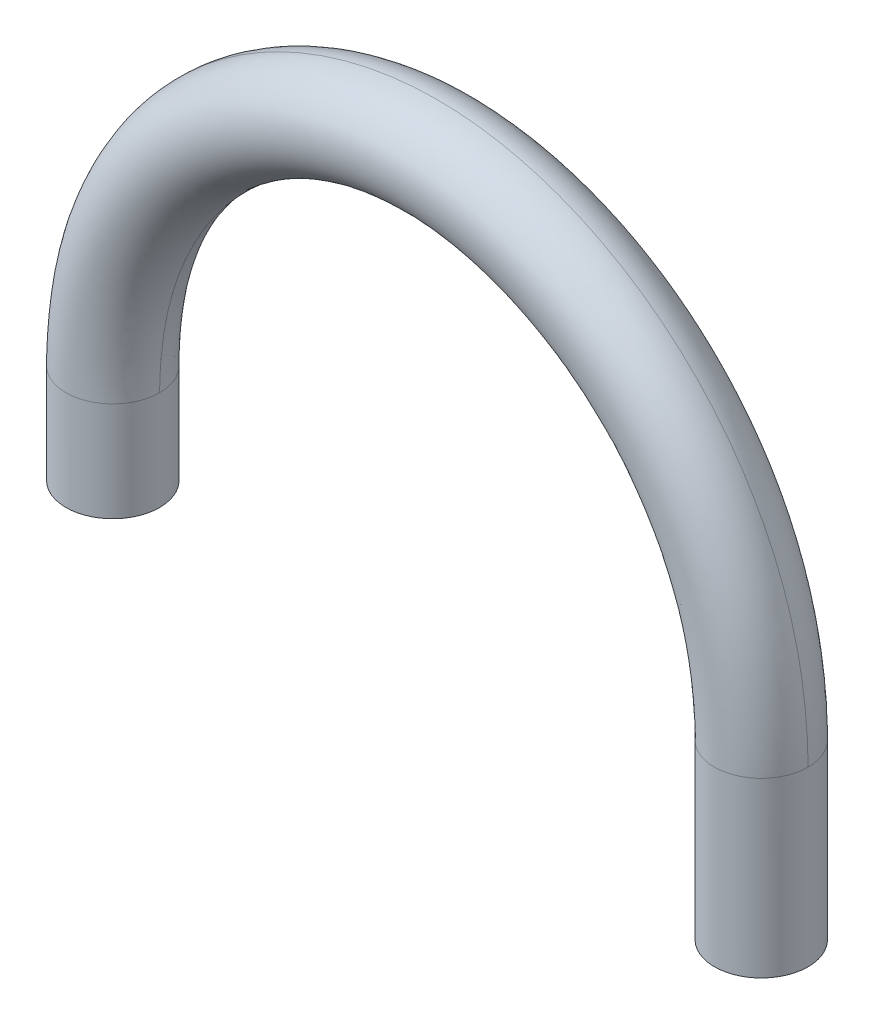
ISO-10303-21;
HEADER;
FILE_DESCRIPTION(('STEP AP214'),'2;1');
FILE_NAME('part.step','',(''),(''),'','','');
FILE_SCHEMA(('AUTOMOTIVE_DESIGN { 1 0 10303 214 1 1 1 1 }'));
ENDSEC;
DATA;
#1=APPLICATION_CONTEXT('core data for automotive mechanical design processes');
#2=APPLICATION_PROTOCOL_DEFINITION('international standard','automotive_design',2000,#1);
#3=PRODUCT_CONTEXT('',#1,'mechanical');
#4=PRODUCT('Part','Part','',(#3));
#5=PRODUCT_RELATED_PRODUCT_CATEGORY('part','',(#4));
#6=PRODUCT_DEFINITION_FORMATION('','',#4);
#7=PRODUCT_DEFINITION_CONTEXT('part definition',#1,'design');
#8=PRODUCT_DEFINITION('design','',#6,#7);
#9=PRODUCT_DEFINITION_SHAPE('','',#8);
#10=(LENGTH_UNIT() NAMED_UNIT(*) SI_UNIT(.MILLI.,.METRE.));
#11=(NAMED_UNIT(*) PLANE_ANGLE_UNIT() SI_UNIT($,.RADIAN.));
#12=(NAMED_UNIT(*) SI_UNIT($,.STERADIAN.) SOLID_ANGLE_UNIT());
#13=UNCERTAINTY_MEASURE_WITH_UNIT(LENGTH_MEASURE(1.E-05),#10,'distance_accuracy_value','');
#14=(GEOMETRIC_REPRESENTATION_CONTEXT(3) GLOBAL_UNCERTAINTY_ASSIGNED_CONTEXT((#13)) GLOBAL_UNIT_ASSIGNED_CONTEXT((#10,
#11,#12)) REPRESENTATION_CONTEXT('',''));
#15=CARTESIAN_POINT('',(0.,0.,0.));
#16=DIRECTION('',(0.,0.,1.));
#17=DIRECTION('',(1.,0.,0.));
#18=AXIS2_PLACEMENT_3D('',#15,#16,#17);
#19=CARTESIAN_POINT('',(-96.055,25.5,-16.445));
#20=DIRECTION('',(0.,1.,0.));
#21=DIRECTION('',(-1.,0.,0.));
#22=AXIS2_PLACEMENT_3D('',#19,#20,#21);
#23=PLANE('',#22);
#24=CARTESIAN_POINT('',(-112.5,25.5,0.));
#25=DIRECTION('',(0.,-1.,0.));
#26=DIRECTION('',(1.,0.,0.));
#27=AXIS2_PLACEMENT_3D('',#24,#25,#26);
#28=CIRCLE('',#27,16.25);
#29=CARTESIAN_POINT('',(-96.25,25.5,0.));
#30=VERTEX_POINT('',#29);
#31=EDGE_CURVE('E20',#30,#30,#28,.T.);
#32=ORIENTED_EDGE('',*,*,#31,.T.);
#33=EDGE_LOOP('',(#32));
#34=FACE_BOUND('',#33,.T.);
#35=ADVANCED_FACE('F16',(#34),#23,.F.);
#36=CARTESIAN_POINT('',(96.055,0.,-16.445));
#37=DIRECTION('',(0.,-1.,0.));
#38=DIRECTION('',(1.,0.,0.));
#39=AXIS2_PLACEMENT_3D('',#36,#37,#38);
#40=PLANE('',#39);
#41=CARTESIAN_POINT('',(112.5,0.,0.));
#42=DIRECTION('',(0.,-1.,0.));
#43=DIRECTION('',(1.,0.,0.));
#44=AXIS2_PLACEMENT_3D('',#41,#42,#43);
#45=CIRCLE('',#44,16.25);
#46=CARTESIAN_POINT('',(128.75,0.,0.));
#47=VERTEX_POINT('',#46);
#48=EDGE_CURVE('E52',#47,#47,#45,.T.);
#49=ORIENTED_EDGE('',*,*,#48,.T.);
#50=EDGE_LOOP('',(#49));
#51=FACE_BOUND('',#50,.T.);
#52=ADVANCED_FACE('F18',(#51),#40,.T.);
#53=CARTESIAN_POINT('',(-112.5,60.,0.));
#54=DIRECTION('',(0.,-1.,0.));
#55=DIRECTION('',(1.,0.,0.));
#56=AXIS2_PLACEMENT_3D('',#53,#54,#55);
#57=CYLINDRICAL_SURFACE('',#56,16.25);
#58=ORIENTED_EDGE('',*,*,#31,.F.);
#59=EDGE_LOOP('',(#58));
#60=FACE_BOUND('',#59,.T.);
#61=CARTESIAN_POINT('',(-112.5,60.,0.));
#62=DIRECTION('',(0.,-1.,0.));
#63=DIRECTION('',(0.,0.,-1.));
#64=AXIS2_PLACEMENT_3D('',#61,#62,#63);
#65=CIRCLE('',#64,16.25);
#66=CARTESIAN_POINT('',(-128.75,60.,1.56280283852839E-09));
#67=VERTEX_POINT('',#66);
#68=CARTESIAN_POINT('',(-96.25,60.,1.6664638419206E-09));
#69=VERTEX_POINT('',#68);
#70=EDGE_CURVE('E26',#67,#69,#65,.T.);
#71=ORIENTED_EDGE('',*,*,#70,.T.);
#72=CARTESIAN_POINT('',(-112.5,60.,0.));
#73=DIRECTION('',(0.,-1.,0.));
#74=DIRECTION('',(0.,0.,-1.));
#75=AXIS2_PLACEMENT_3D('',#72,#73,#74);
#76=CIRCLE('',#75,16.25);
#77=EDGE_CURVE('E43',#69,#67,#76,.T.);
#78=ORIENTED_EDGE('',*,*,#77,.T.);
#79=EDGE_LOOP('',(#71,#78));
#80=FACE_BOUND('',#79,.T.);
#81=ADVANCED_FACE('F76',(#60,#80),#57,.T.);
#82=CARTESIAN_POINT('',(128.75,60.,0.));
#83=CARTESIAN_POINT('',(128.75,69.119381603,0.));
#84=CARTESIAN_POINT('',(126.787885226,90.221251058,0.));
#85=CARTESIAN_POINT('',(118.575613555,116.218092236,0.));
#86=CARTESIAN_POINT('',(105.814695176,139.782338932,0.));
#87=CARTESIAN_POINT('',(89.27785199,159.546384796,0.));
#88=CARTESIAN_POINT('',(69.728355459,175.473072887,0.));
#89=CARTESIAN_POINT('',(47.880351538,187.225005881,0.));
#90=CARTESIAN_POINT('',(24.433883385,194.543640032,0.));
#91=CARTESIAN_POINT('',(0.,197.103179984,0.));
#92=CARTESIAN_POINT('',(-24.433883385,194.543640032,0.));
#93=CARTESIAN_POINT('',(-47.880351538,187.225005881,0.));
#94=CARTESIAN_POINT('',(-69.728355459,175.473072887,0.));
#95=CARTESIAN_POINT('',(-89.27785199,159.546384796,0.));
#96=CARTESIAN_POINT('',(-105.814695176,139.782338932,0.));
#97=CARTESIAN_POINT('',(-118.575613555,116.218092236,0.));
#98=CARTESIAN_POINT('',(-126.787885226,90.221251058,0.));
#99=CARTESIAN_POINT('',(-128.75,69.119381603,0.));
#100=CARTESIAN_POINT('',(-128.75,60.,0.));
#101=CARTESIAN_POINT('',(128.75,60.,32.5));
#102=CARTESIAN_POINT('',(128.75,65.927697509,32.5));
#103=CARTESIAN_POINT('',(126.787885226,91.702516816,32.5));
#104=CARTESIAN_POINT('',(118.575613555,115.821188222,32.5));
#105=CARTESIAN_POINT('',(105.814695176,139.888689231,32.5));
#106=CARTESIAN_POINT('',(89.27785199,159.517887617,32.5));
#107=CARTESIAN_POINT('',(69.728355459,175.480711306,32.5));
#108=CARTESIAN_POINT('',(47.880351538,187.222949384,32.5));
#109=CARTESIAN_POINT('',(24.433883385,194.544227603,32.5));
#110=CARTESIAN_POINT('',(0.,197.102886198,32.5));
#111=CARTESIAN_POINT('',(-24.433883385,194.544227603,32.5));
#112=CARTESIAN_POINT('',(-47.880351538,187.222949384,32.5));
#113=CARTESIAN_POINT('',(-69.728355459,175.480711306,32.5));
#114=CARTESIAN_POINT('',(-89.27785199,159.517887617,32.5));
#115=CARTESIAN_POINT('',(-105.814695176,139.888689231,32.5));
#116=CARTESIAN_POINT('',(-118.575613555,115.821188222,32.5));
#117=CARTESIAN_POINT('',(-126.787885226,91.702516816,32.5));
#118=CARTESIAN_POINT('',(-128.75,65.927697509,32.5));
#119=CARTESIAN_POINT('',(-128.75,60.,32.5));
#120=CARTESIAN_POINT('',(96.25,60.,32.5));
#121=CARTESIAN_POINT('',(96.25,65.927697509,32.5));
#122=CARTESIAN_POINT('',(94.696489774,84.356921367,32.5));
#123=CARTESIAN_POINT('',(88.40680832,103.415634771,32.5));
#124=CARTESIAN_POINT('',(78.755617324,121.439526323,32.5));
#125=CARTESIAN_POINT('',(66.28855426,136.281328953,32.5));
#126=CARTESIAN_POINT('',(51.560707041,148.291936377,32.5));
#127=CARTESIAN_POINT('',(35.176289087,157.096584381,32.5));
#128=CARTESIAN_POINT('',(17.753616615,162.516638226,32.5));
#129=CARTESIAN_POINT('',(0.,164.366680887,32.5));
#130=CARTESIAN_POINT('',(-17.753616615,162.516638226,32.5));
#131=CARTESIAN_POINT('',(-35.176289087,157.096584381,32.5));
#132=CARTESIAN_POINT('',(-51.560707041,148.291936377,32.5));
#133=CARTESIAN_POINT('',(-66.28855426,136.281328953,32.5));
#134=CARTESIAN_POINT('',(-78.755617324,121.439526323,32.5));
#135=CARTESIAN_POINT('',(-88.40680832,103.415634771,32.5));
#136=CARTESIAN_POINT('',(-94.696489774,84.356921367,32.5));
#137=CARTESIAN_POINT('',(-96.25,65.927697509,32.5));
#138=CARTESIAN_POINT('',(-96.25,60.,32.5));
#139=CARTESIAN_POINT('',(96.25,60.,0.));
#140=CARTESIAN_POINT('',(96.25,67.523539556,0.));
#141=CARTESIAN_POINT('',(94.696489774,83.616288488,0.));
#142=CARTESIAN_POINT('',(88.40680832,103.614086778,0.));
#143=CARTESIAN_POINT('',(78.755617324,121.386351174,0.));
#144=CARTESIAN_POINT('',(66.28855426,136.295577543,0.));
#145=CARTESIAN_POINT('',(51.560707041,148.288117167,0.));
#146=CARTESIAN_POINT('',(35.176289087,157.097612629,0.));
#147=CARTESIAN_POINT('',(17.753616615,162.516344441,0.));
#148=CARTESIAN_POINT('',(0.,164.36682778,0.));
#149=CARTESIAN_POINT('',(-17.753616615,162.516344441,0.));
#150=CARTESIAN_POINT('',(-35.176289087,157.097612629,0.));
#151=CARTESIAN_POINT('',(-51.560707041,148.288117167,0.));
#152=CARTESIAN_POINT('',(-66.28855426,136.295577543,0.));
#153=CARTESIAN_POINT('',(-78.755617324,121.386351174,0.));
#154=CARTESIAN_POINT('',(-88.40680832,103.614086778,0.));
#155=CARTESIAN_POINT('',(-94.696489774,83.616288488,0.));
#156=CARTESIAN_POINT('',(-96.25,67.523539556,0.));
#157=CARTESIAN_POINT('',(-96.25,60.,0.));
#158=(BOUNDED_SURFACE() B_SPLINE_SURFACE(3,3,((#82,#83,#84,#85,#86,#87,#88,#89,#90,#91,#92,#93,
#94,#95,#96,#97,#98,#99,#100),(#101,#102,#103,#104,#105,#106,#107,#108,#109,#110,#111,#112,#113,
#114,#115,#116,#117,#118,#119),(#120,#121,#122,#123,#124,#125,#126,#127,#128,#129,#130,#131,
#132,#133,#134,#135,#136,#137,#138),(#139,#140,#141,#142,#143,#144,#145,#146,#147,#148,#149,
#150,#151,#152,#153,#154,#155,#156,#157)),.UNSPECIFIED.,.F.,.F.,
.F.) B_SPLINE_SURFACE_WITH_KNOTS((4,4),(4,1,1,1,1,1,1,1,1,1,1,1,1,1,1,1,4),(0.,0.5),(0.,
0.0624999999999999,0.125,0.1875,0.25,0.3125,0.375,0.437499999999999,0.5,0.562500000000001,0.625,
0.6875,0.75,0.8125,0.875,0.9375,1.),
.UNSPECIFIED.) GEOMETRIC_REPRESENTATION_ITEM() RATIONAL_B_SPLINE_SURFACE(((1.,1.,1.,1.,1.,1.,1.,
1.,1.,1.,1.,1.,1.,1.,1.,1.,1.,1.,1.),(0.333333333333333,0.333333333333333,0.333333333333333,
0.333333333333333,0.333333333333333,0.333333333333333,0.333333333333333,0.333333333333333,
0.333333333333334,0.333333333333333,0.333333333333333,0.333333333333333,0.333333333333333,
0.333333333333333,0.333333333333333,0.333333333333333,0.333333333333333,0.333333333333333,
0.333333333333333),(0.333333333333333,0.333333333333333,0.333333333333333,0.333333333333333,
0.333333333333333,0.333333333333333,0.333333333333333,0.333333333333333,0.333333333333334,
0.333333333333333,0.333333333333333,0.333333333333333,0.333333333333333,0.333333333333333,
0.333333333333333,0.333333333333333,0.333333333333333,0.333333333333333,0.333333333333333),(1.,
1.,1.,1.,1.,1.,1.,1.,1.,1.,1.,1.,1.,1.,1.,1.,1.,1.,1.))) REPRESENTATION_ITEM('') SURFACE());
#159=CARTESIAN_POINT('',(112.5,60.,0.));
#160=DIRECTION('',(0.,-1.,0.));
#161=DIRECTION('',(0.,0.,-1.));
#162=AXIS2_PLACEMENT_3D('',#159,#160,#161);
#163=CIRCLE('',#162,16.25);
#164=CARTESIAN_POINT('',(96.25,60.,1.56280283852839E-09));
#165=VERTEX_POINT('',#164);
#166=CARTESIAN_POINT('',(128.75,60.,1.6664638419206E-09));
#167=VERTEX_POINT('',#166);
#168=EDGE_CURVE('E48',#165,#167,#163,.F.);
#169=CARTESIAN_POINT('',(128.75,60.,0.));
#170=CARTESIAN_POINT('',(128.75,69.119381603,0.));
#171=CARTESIAN_POINT('',(126.787885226,90.221251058,0.));
#172=CARTESIAN_POINT('',(118.575613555,116.218092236,0.));
#173=CARTESIAN_POINT('',(105.814695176,139.782338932,0.));
#174=CARTESIAN_POINT('',(89.27785199,159.546384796,0.));
#175=CARTESIAN_POINT('',(69.728355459,175.473072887,0.));
#176=CARTESIAN_POINT('',(47.880351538,187.225005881,0.));
#177=CARTESIAN_POINT('',(24.433883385,194.543640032,0.));
#178=CARTESIAN_POINT('',(0.,197.103179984,0.));
#179=CARTESIAN_POINT('',(-24.433883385,194.543640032,0.));
#180=CARTESIAN_POINT('',(-47.880351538,187.225005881,0.));
#181=CARTESIAN_POINT('',(-69.728355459,175.473072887,0.));
#182=CARTESIAN_POINT('',(-89.27785199,159.546384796,0.));
#183=CARTESIAN_POINT('',(-105.814695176,139.782338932,0.));
#184=CARTESIAN_POINT('',(-118.575613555,116.218092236,0.));
#185=CARTESIAN_POINT('',(-126.787885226,90.221251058,0.));
#186=CARTESIAN_POINT('',(-128.75,69.119381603,0.));
#187=CARTESIAN_POINT('',(-128.75,60.,0.));
#188=B_SPLINE_CURVE_WITH_KNOTS('',3,(#169,#170,#171,#172,#173,#174,#175,#176,#177,#178,#179,
#180,#181,#182,#183,#184,#185,#186,#187),.UNSPECIFIED.,.F.,.F.,(4,1,1,1,1,1,1,1,1,1,1,1,1,1,1,1,
4),(0.,0.0624999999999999,0.125,0.1875,0.25,0.3125,0.375,0.437499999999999,0.5,
0.562500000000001,0.625,0.6875,0.75,0.8125,0.875,0.9375,1.),.UNSPECIFIED.);
#189=EDGE_CURVE('E50',#167,#67,#188,.T.);
#190=CARTESIAN_POINT('',(96.25,60.,0.));
#191=CARTESIAN_POINT('',(96.25,67.523539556,0.));
#192=CARTESIAN_POINT('',(94.696489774,83.616288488,0.));
#193=CARTESIAN_POINT('',(88.40680832,103.614086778,0.));
#194=CARTESIAN_POINT('',(78.755617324,121.386351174,0.));
#195=CARTESIAN_POINT('',(66.28855426,136.295577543,0.));
#196=CARTESIAN_POINT('',(51.560707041,148.288117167,0.));
#197=CARTESIAN_POINT('',(35.176289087,157.097612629,0.));
#198=CARTESIAN_POINT('',(17.753616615,162.516344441,0.));
#199=CARTESIAN_POINT('',(0.,164.36682778,0.));
#200=CARTESIAN_POINT('',(-17.753616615,162.516344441,0.));
#201=CARTESIAN_POINT('',(-35.176289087,157.097612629,0.));
#202=CARTESIAN_POINT('',(-51.560707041,148.288117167,0.));
#203=CARTESIAN_POINT('',(-66.28855426,136.295577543,0.));
#204=CARTESIAN_POINT('',(-78.755617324,121.386351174,0.));
#205=CARTESIAN_POINT('',(-88.40680832,103.614086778,0.));
#206=CARTESIAN_POINT('',(-94.696489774,83.616288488,0.));
#207=CARTESIAN_POINT('',(-96.25,67.523539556,0.));
#208=CARTESIAN_POINT('',(-96.25,60.,0.));
#209=B_SPLINE_CURVE_WITH_KNOTS('',3,(#190,#191,#192,#193,#194,#195,#196,#197,#198,#199,#200,
#201,#202,#203,#204,#205,#206,#207,#208),.UNSPECIFIED.,.F.,.F.,(4,1,1,1,1,1,1,1,1,1,1,1,1,1,1,1,
4),(0.,0.0624999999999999,0.125,0.1875,0.25,0.3125,0.375,0.437499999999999,0.5,
0.562500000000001,0.625,0.6875,0.75,0.8125,0.875,0.9375,1.),.UNSPECIFIED.);
#210=EDGE_CURVE('E11',#69,#165,#209,.F.);
#211=ORIENTED_EDGE('',*,*,#168,.T.);
#212=ORIENTED_EDGE('',*,*,#189,.T.);
#213=ORIENTED_EDGE('',*,*,#77,.F.);
#214=ORIENTED_EDGE('',*,*,#210,.T.);
#215=EDGE_LOOP('',(#211,#212,#213,#214));
#216=FACE_BOUND('',#215,.T.);
#217=ADVANCED_FACE('F49',(#216),#158,.F.);
#218=CARTESIAN_POINT('',(112.5,60.,0.));
#219=DIRECTION('',(0.,-1.,0.));
#220=DIRECTION('',(1.,0.,0.));
#221=AXIS2_PLACEMENT_3D('',#218,#219,#220);
#222=CYLINDRICAL_SURFACE('',#221,16.25);
#223=ORIENTED_EDGE('',*,*,#168,.F.);
#224=CARTESIAN_POINT('',(112.5,60.,0.));
#225=DIRECTION('',(0.,-1.,0.));
#226=DIRECTION('',(0.,0.,-1.));
#227=AXIS2_PLACEMENT_3D('',#224,#225,#226);
#228=CIRCLE('',#227,16.25);
#229=EDGE_CURVE('E35',#165,#167,#228,.T.);
#230=ORIENTED_EDGE('',*,*,#229,.T.);
#231=EDGE_LOOP('',(#223,#230));
#232=FACE_BOUND('',#231,.T.);
#233=ORIENTED_EDGE('',*,*,#48,.F.);
#234=EDGE_LOOP('',(#233));
#235=FACE_BOUND('',#234,.T.);
#236=ADVANCED_FACE('F56',(#232,#235),#222,.T.);
#237=CARTESIAN_POINT('',(96.25,60.,0.));
#238=CARTESIAN_POINT('',(96.25,67.523539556,0.));
#239=CARTESIAN_POINT('',(94.696489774,83.616288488,0.));
#240=CARTESIAN_POINT('',(88.40680832,103.614086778,0.));
#241=CARTESIAN_POINT('',(78.755617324,121.386351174,0.));
#242=CARTESIAN_POINT('',(66.28855426,136.295577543,0.));
#243=CARTESIAN_POINT('',(51.560707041,148.288117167,0.));
#244=CARTESIAN_POINT('',(35.176289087,157.097612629,0.));
#245=CARTESIAN_POINT('',(17.753616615,162.516344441,0.));
#246=CARTESIAN_POINT('',(0.,164.36682778,0.));
#247=CARTESIAN_POINT('',(-17.753616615,162.516344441,0.));
#248=CARTESIAN_POINT('',(-35.176289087,157.097612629,0.));
#249=CARTESIAN_POINT('',(-51.560707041,148.288117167,0.));
#250=CARTESIAN_POINT('',(-66.28855426,136.295577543,0.));
#251=CARTESIAN_POINT('',(-78.755617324,121.386351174,0.));
#252=CARTESIAN_POINT('',(-88.40680832,103.614086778,0.));
#253=CARTESIAN_POINT('',(-94.696489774,83.616288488,0.));
#254=CARTESIAN_POINT('',(-96.25,67.523539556,0.));
#255=CARTESIAN_POINT('',(-96.25,60.,0.));
#256=CARTESIAN_POINT('',(96.25,60.,-32.5));
#257=CARTESIAN_POINT('',(96.25,69.119381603,-32.5));
#258=CARTESIAN_POINT('',(94.696489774,82.875655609,-32.5));
#259=CARTESIAN_POINT('',(88.40680832,103.812538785,-32.5));
#260=CARTESIAN_POINT('',(78.755617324,121.333176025,-32.5));
#261=CARTESIAN_POINT('',(66.28855426,136.309826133,-32.5));
#262=CARTESIAN_POINT('',(51.560707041,148.284297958,-32.5));
#263=CARTESIAN_POINT('',(35.176289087,157.098640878,-32.5));
#264=CARTESIAN_POINT('',(17.753616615,162.516050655,-32.5));
#265=CARTESIAN_POINT('',(0.,164.366974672,-32.5));
#266=CARTESIAN_POINT('',(-17.753616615,162.516050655,-32.5));
#267=CARTESIAN_POINT('',(-35.176289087,157.098640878,-32.5));
#268=CARTESIAN_POINT('',(-51.560707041,148.284297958,-32.5));
#269=CARTESIAN_POINT('',(-66.28855426,136.309826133,-32.5));
#270=CARTESIAN_POINT('',(-78.755617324,121.333176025,-32.5));
#271=CARTESIAN_POINT('',(-88.40680832,103.812538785,-32.5));
#272=CARTESIAN_POINT('',(-94.696489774,82.875655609,-32.5));
#273=CARTESIAN_POINT('',(-96.25,69.119381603,-32.5));
#274=CARTESIAN_POINT('',(-96.25,60.,-32.5));
#275=CARTESIAN_POINT('',(128.75,60.,-32.5));
#276=CARTESIAN_POINT('',(128.75,72.311065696,-32.5));
#277=CARTESIAN_POINT('',(126.787885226,88.7399853,-32.5));
#278=CARTESIAN_POINT('',(118.575613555,116.61499625,-32.5));
#279=CARTESIAN_POINT('',(105.814695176,139.675988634,-32.5));
#280=CARTESIAN_POINT('',(89.27785199,159.574881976,-32.5));
#281=CARTESIAN_POINT('',(69.728355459,175.465434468,-32.5));
#282=CARTESIAN_POINT('',(47.880351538,187.227062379,-32.5));
#283=CARTESIAN_POINT('',(24.433883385,194.543052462,-32.5));
#284=CARTESIAN_POINT('',(0.,197.103473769,-32.5));
#285=CARTESIAN_POINT('',(-24.433883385,194.543052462,-32.5));
#286=CARTESIAN_POINT('',(-47.880351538,187.227062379,-32.5));
#287=CARTESIAN_POINT('',(-69.728355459,175.465434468,-32.5));
#288=CARTESIAN_POINT('',(-89.27785199,159.574881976,-32.5));
#289=CARTESIAN_POINT('',(-105.814695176,139.675988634,-32.5));
#290=CARTESIAN_POINT('',(-118.575613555,116.61499625,-32.5));
#291=CARTESIAN_POINT('',(-126.787885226,88.7399853,-32.5));
#292=CARTESIAN_POINT('',(-128.75,72.311065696,-32.5));
#293=CARTESIAN_POINT('',(-128.75,60.,-32.5));
#294=CARTESIAN_POINT('',(128.75,60.,0.));
#295=CARTESIAN_POINT('',(128.75,69.119381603,0.));
#296=CARTESIAN_POINT('',(126.787885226,90.221251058,0.));
#297=CARTESIAN_POINT('',(118.575613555,116.218092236,0.));
#298=CARTESIAN_POINT('',(105.814695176,139.782338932,0.));
#299=CARTESIAN_POINT('',(89.27785199,159.546384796,0.));
#300=CARTESIAN_POINT('',(69.728355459,175.473072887,0.));
#301=CARTESIAN_POINT('',(47.880351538,187.225005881,0.));
#302=CARTESIAN_POINT('',(24.433883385,194.543640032,0.));
#303=CARTESIAN_POINT('',(0.,197.103179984,0.));
#304=CARTESIAN_POINT('',(-24.433883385,194.543640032,0.));
#305=CARTESIAN_POINT('',(-47.880351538,187.225005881,0.));
#306=CARTESIAN_POINT('',(-69.728355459,175.473072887,0.));
#307=CARTESIAN_POINT('',(-89.27785199,159.546384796,0.));
#308=CARTESIAN_POINT('',(-105.814695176,139.782338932,0.));
#309=CARTESIAN_POINT('',(-118.575613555,116.218092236,0.));
#310=CARTESIAN_POINT('',(-126.787885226,90.221251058,0.));
#311=CARTESIAN_POINT('',(-128.75,69.119381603,0.));
#312=CARTESIAN_POINT('',(-128.75,60.,0.));
#313=(BOUNDED_SURFACE() B_SPLINE_SURFACE(3,3,((#237,#238,#239,#240,#241,#242,#243,#244,#245,
#246,#247,#248,#249,#250,#251,#252,#253,#254,#255),(#256,#257,#258,#259,#260,#261,#262,#263,
#264,#265,#266,#267,#268,#269,#270,#271,#272,#273,#274),(#275,#276,#277,#278,#279,#280,#281,
#282,#283,#284,#285,#286,#287,#288,#289,#290,#291,#292,#293),(#294,#295,#296,#297,#298,#299,
#300,#301,#302,#303,#304,#305,#306,#307,#308,#309,#310,#311,#312)),.UNSPECIFIED.,.F.,.F.,
.F.) B_SPLINE_SURFACE_WITH_KNOTS((4,4),(4,1,1,1,1,1,1,1,1,1,1,1,1,1,1,1,4),(0.5,1.),(0.,
0.0624999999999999,0.125,0.1875,0.25,0.3125,0.375,0.437499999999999,0.5,0.562500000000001,0.625,
0.6875,0.75,0.8125,0.875,0.9375,1.),
.UNSPECIFIED.) GEOMETRIC_REPRESENTATION_ITEM() RATIONAL_B_SPLINE_SURFACE(((1.,1.,1.,1.,1.,1.,1.,
1.,1.,1.,1.,1.,1.,1.,1.,1.,1.,1.,1.),(0.333333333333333,0.333333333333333,0.333333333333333,
0.333333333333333,0.333333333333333,0.333333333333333,0.333333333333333,0.333333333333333,
0.333333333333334,0.333333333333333,0.333333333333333,0.333333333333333,0.333333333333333,
0.333333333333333,0.333333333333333,0.333333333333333,0.333333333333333,0.333333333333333,
0.333333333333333),(0.333333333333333,0.333333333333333,0.333333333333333,0.333333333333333,
0.333333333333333,0.333333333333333,0.333333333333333,0.333333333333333,0.333333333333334,
0.333333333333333,0.333333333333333,0.333333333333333,0.333333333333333,0.333333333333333,
0.333333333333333,0.333333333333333,0.333333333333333,0.333333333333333,0.333333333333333),(1.,
1.,1.,1.,1.,1.,1.,1.,1.,1.,1.,1.,1.,1.,1.,1.,1.,1.,1.))) REPRESENTATION_ITEM('') SURFACE());
#314=ORIENTED_EDGE('',*,*,#210,.F.);
#315=ORIENTED_EDGE('',*,*,#70,.F.);
#316=ORIENTED_EDGE('',*,*,#189,.F.);
#317=ORIENTED_EDGE('',*,*,#229,.F.);
#318=EDGE_LOOP('',(#314,#315,#316,#317));
#319=FACE_BOUND('',#318,.T.);
#320=ADVANCED_FACE('F54',(#319),#313,.F.);
#321=CLOSED_SHELL('',(#35,#52,#81,#217,#236,#320));
#322=MANIFOLD_SOLID_BREP('B1',#321);
#323=ADVANCED_BREP_SHAPE_REPRESENTATION('',(#18,#322),#14);
#324=SHAPE_DEFINITION_REPRESENTATION(#9,#323);
ENDSEC;
END-ISO-10303-21;
